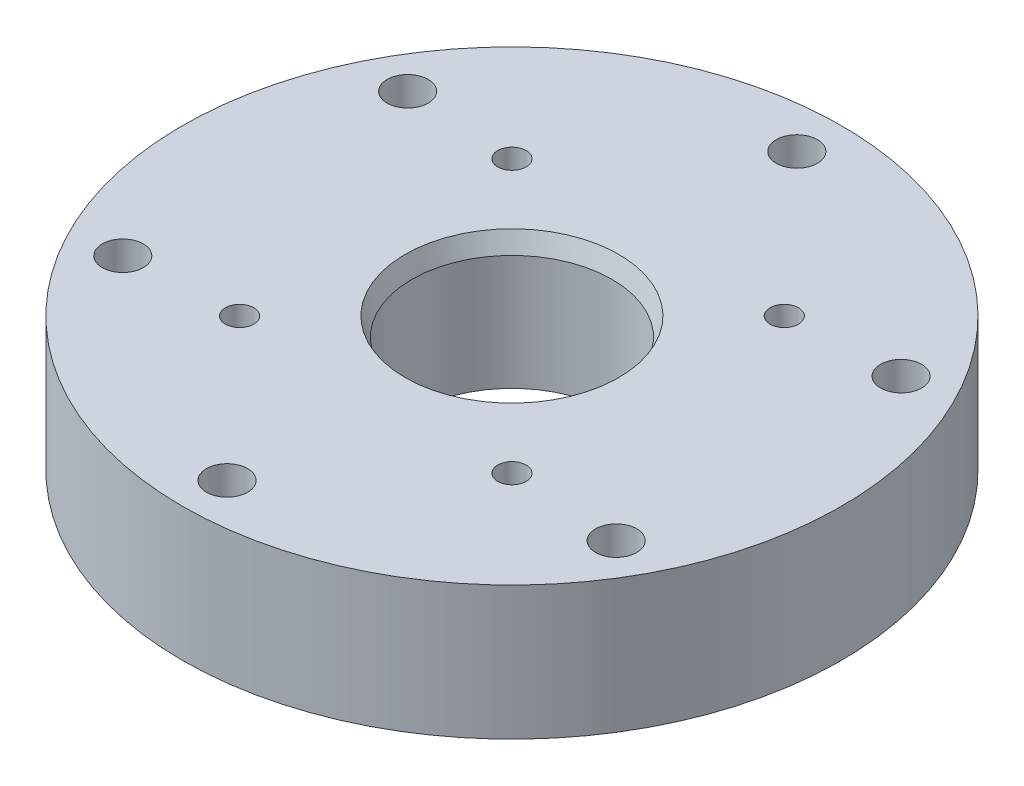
ISO-10303-21;
HEADER;
FILE_DESCRIPTION(('STEP AP214'),'2;1');
FILE_NAME('part.step','',(''),(''),'','','');
FILE_SCHEMA(('AUTOMOTIVE_DESIGN { 1 0 10303 214 1 1 1 1 }'));
ENDSEC;
DATA;
#1=APPLICATION_CONTEXT('core data for automotive mechanical design processes');
#2=APPLICATION_PROTOCOL_DEFINITION('international standard','automotive_design',2000,#1);
#3=PRODUCT_CONTEXT('',#1,'mechanical');
#4=PRODUCT('Part','Part','',(#3));
#5=PRODUCT_RELATED_PRODUCT_CATEGORY('part','',(#4));
#6=PRODUCT_DEFINITION_FORMATION('','',#4);
#7=PRODUCT_DEFINITION_CONTEXT('part definition',#1,'design');
#8=PRODUCT_DEFINITION('design','',#6,#7);
#9=PRODUCT_DEFINITION_SHAPE('','',#8);
#10=(LENGTH_UNIT() NAMED_UNIT(*) SI_UNIT(.MILLI.,.METRE.));
#11=(NAMED_UNIT(*) PLANE_ANGLE_UNIT() SI_UNIT($,.RADIAN.));
#12=(NAMED_UNIT(*) SI_UNIT($,.STERADIAN.) SOLID_ANGLE_UNIT());
#13=UNCERTAINTY_MEASURE_WITH_UNIT(LENGTH_MEASURE(1.E-05),#10,'distance_accuracy_value','');
#14=(GEOMETRIC_REPRESENTATION_CONTEXT(3) GLOBAL_UNCERTAINTY_ASSIGNED_CONTEXT((#13)) GLOBAL_UNIT_ASSIGNED_CONTEXT((#10,
#11,#12)) REPRESENTATION_CONTEXT('',''));
#15=CARTESIAN_POINT('',(0.,0.,0.));
#16=DIRECTION('',(0.,0.,1.));
#17=DIRECTION('',(1.,0.,0.));
#18=AXIS2_PLACEMENT_3D('',#15,#16,#17);
#19=CARTESIAN_POINT('',(31.353125,0.,0.));
#20=DIRECTION('',(0.,1.,0.));
#21=DIRECTION('',(0.,0.,1.));
#22=AXIS2_PLACEMENT_3D('',#19,#20,#21);
#23=PLANE('',#22);
#24=CARTESIAN_POINT('',(1.89084858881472E-13,0.,27.1017999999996));
#25=DIRECTION('',(0.,1.,0.));
#26=DIRECTION('',(0.866025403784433,0.,0.50000000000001));
#27=AXIS2_PLACEMENT_3D('',#24,#25,#26);
#28=CIRCLE('',#27,1.9558);
#29=CARTESIAN_POINT('',(1.69377248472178,0.,28.0796999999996));
#30=VERTEX_POINT('',#29);
#31=EDGE_CURVE('E85',#30,#30,#28,.T.);
#32=ORIENTED_EDGE('',*,*,#31,.T.);
#33=EDGE_LOOP('',(#32));
#34=FACE_BOUND('',#33,.T.);
#35=CARTESIAN_POINT('',(23.4708472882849,0.,13.5508999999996));
#36=DIRECTION('',(0.,1.,0.));
#37=DIRECTION('',(0.866025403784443,0.,-0.499999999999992));
#38=AXIS2_PLACEMENT_3D('',#35,#36,#37);
#39=CIRCLE('',#38,1.9558);
#40=CARTESIAN_POINT('',(25.1646197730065,0.,12.5729999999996));
#41=VERTEX_POINT('',#40);
#42=EDGE_CURVE('E91',#41,#41,#39,.T.);
#43=ORIENTED_EDGE('',*,*,#42,.T.);
#44=EDGE_LOOP('',(#43));
#45=FACE_BOUND('',#44,.T.);
#46=CARTESIAN_POINT('',(23.4708472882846,0.,-13.5509000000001));
#47=DIRECTION('',(0.,1.,0.));
#48=DIRECTION('',(0.,0.,-1.));
#49=AXIS2_PLACEMENT_3D('',#46,#47,#48);
#50=CIRCLE('',#49,1.9558);
#51=CARTESIAN_POINT('',(23.4708472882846,0.,-15.5067000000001));
#52=VERTEX_POINT('',#51);
#53=EDGE_CURVE('E97',#52,#52,#50,.T.);
#54=ORIENTED_EDGE('',*,*,#53,.T.);
#55=EDGE_LOOP('',(#54));
#56=FACE_BOUND('',#55,.T.);
#57=CARTESIAN_POINT('',(-3.79904441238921E-13,0.,-27.1017999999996));
#58=DIRECTION('',(0.,1.,0.));
#59=DIRECTION('',(-0.866025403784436,0.,-0.500000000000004));
#60=AXIS2_PLACEMENT_3D('',#57,#58,#59);
#61=CIRCLE('',#60,1.9558);
#62=CARTESIAN_POINT('',(-1.69377248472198,0.,-28.0796999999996));
#63=VERTEX_POINT('',#62);
#64=EDGE_CURVE('E103',#63,#63,#61,.T.);
#65=ORIENTED_EDGE('',*,*,#64,.T.);
#66=EDGE_LOOP('',(#65));
#67=FACE_BOUND('',#66,.T.);
#68=CARTESIAN_POINT('',(-23.470847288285,0.,-13.5508999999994));
#69=DIRECTION('',(0.,1.,0.));
#70=DIRECTION('',(-0.86602540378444,0.,0.499999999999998));
#71=AXIS2_PLACEMENT_3D('',#68,#69,#70);
#72=CIRCLE('',#71,1.9558);
#73=CARTESIAN_POINT('',(-25.1646197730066,0.,-12.5729999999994));
#74=VERTEX_POINT('',#73);
#75=EDGE_CURVE('E109',#74,#74,#72,.T.);
#76=ORIENTED_EDGE('',*,*,#75,.T.);
#77=EDGE_LOOP('',(#76));
#78=FACE_BOUND('',#77,.T.);
#79=CARTESIAN_POINT('',(-23.4708472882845,0.,13.5509000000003));
#80=DIRECTION('',(0.,1.,0.));
#81=DIRECTION('',(0.,0.,1.));
#82=AXIS2_PLACEMENT_3D('',#79,#80,#81);
#83=CIRCLE('',#82,1.9558);
#84=CARTESIAN_POINT('',(-23.4708472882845,0.,15.5067000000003));
#85=VERTEX_POINT('',#84);
#86=EDGE_CURVE('E115',#85,#85,#83,.T.);
#87=ORIENTED_EDGE('',*,*,#86,.T.);
#88=EDGE_LOOP('',(#87));
#89=FACE_BOUND('',#88,.T.);
#90=CARTESIAN_POINT('',(0.,0.,0.));
#91=DIRECTION('',(0.,1.,0.));
#92=DIRECTION('',(0.,0.,1.));
#93=AXIS2_PLACEMENT_3D('',#90,#91,#92);
#94=CIRCLE('',#93,31.353125);
#95=CARTESIAN_POINT('',(0.,0.,31.353125));
#96=VERTEX_POINT('',#95);
#97=EDGE_CURVE('E11',#96,#96,#94,.T.);
#98=ORIENTED_EDGE('',*,*,#97,.F.);
#99=EDGE_LOOP('',(#98));
#100=FACE_BOUND('',#99,.T.);
#101=CARTESIAN_POINT('',(0.,0.,0.));
#102=DIRECTION('',(0.,1.,0.));
#103=DIRECTION('',(0.,0.,1.));
#104=AXIS2_PLACEMENT_3D('',#101,#102,#103);
#105=CIRCLE('',#104,9.52500000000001);
#106=CARTESIAN_POINT('',(0.,0.,9.52500000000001));
#107=VERTEX_POINT('',#106);
#108=EDGE_CURVE('E118',#107,#107,#105,.T.);
#109=ORIENTED_EDGE('',*,*,#108,.T.);
#110=EDGE_LOOP('',(#109));
#111=FACE_BOUND('',#110,.T.);
#112=ADVANCED_FACE('F32',(#34,#45,#56,#67,#78,#89,#100,#111),#23,.F.);
#113=CARTESIAN_POINT('',(0.,61.0123711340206,0.));
#114=DIRECTION('',(0.,1.,0.));
#115=DIRECTION('',(0.,0.,1.));
#116=AXIS2_PLACEMENT_3D('',#113,#114,#115);
#117=CYLINDRICAL_SURFACE('',#116,31.353125);
#118=CARTESIAN_POINT('',(0.,12.7,0.));
#119=DIRECTION('',(0.,1.,0.));
#120=DIRECTION('',(0.,0.,1.));
#121=AXIS2_PLACEMENT_3D('',#118,#119,#120);
#122=CIRCLE('',#121,31.353125);
#123=CARTESIAN_POINT('',(0.,12.7,31.353125));
#124=VERTEX_POINT('',#123);
#125=EDGE_CURVE('E39',#124,#124,#122,.T.);
#126=ORIENTED_EDGE('',*,*,#125,.F.);
#127=EDGE_LOOP('',(#126));
#128=FACE_BOUND('',#127,.T.);
#129=ORIENTED_EDGE('',*,*,#97,.T.);
#130=EDGE_LOOP('',(#129));
#131=FACE_BOUND('',#130,.T.);
#132=ADVANCED_FACE('F133',(#128,#131),#117,.T.);
#133=CARTESIAN_POINT('',(10.16,12.7,0.));
#134=DIRECTION('',(0.,-1.,0.));
#135=DIRECTION('',(0.,0.,-1.));
#136=AXIS2_PLACEMENT_3D('',#133,#134,#135);
#137=PLANE('',#136);
#138=CARTESIAN_POINT('',(12.954,12.7,-12.954));
#139=DIRECTION('',(0.,1.,0.));
#140=DIRECTION('',(0.,0.,1.));
#141=AXIS2_PLACEMENT_3D('',#138,#139,#140);
#142=CIRCLE('',#141,1.3525488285);
#143=CARTESIAN_POINT('',(12.954,12.7,-11.6014511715));
#144=VERTEX_POINT('',#143);
#145=EDGE_CURVE('E61',#144,#144,#142,.T.);
#146=ORIENTED_EDGE('',*,*,#145,.F.);
#147=EDGE_LOOP('',(#146));
#148=FACE_BOUND('',#147,.T.);
#149=CARTESIAN_POINT('',(12.954,12.7,12.954));
#150=DIRECTION('',(0.,1.,0.));
#151=DIRECTION('',(0.,0.,1.));
#152=AXIS2_PLACEMENT_3D('',#149,#150,#151);
#153=CIRCLE('',#152,1.3525488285);
#154=CARTESIAN_POINT('',(12.954,12.7,14.3065488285));
#155=VERTEX_POINT('',#154);
#156=EDGE_CURVE('E69',#155,#155,#153,.T.);
#157=ORIENTED_EDGE('',*,*,#156,.F.);
#158=EDGE_LOOP('',(#157));
#159=FACE_BOUND('',#158,.T.);
#160=CARTESIAN_POINT('',(-12.954,12.7,-12.954));
#161=DIRECTION('',(0.,1.,0.));
#162=DIRECTION('',(0.,0.,1.));
#163=AXIS2_PLACEMENT_3D('',#160,#161,#162);
#164=CIRCLE('',#163,1.3525488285);
#165=CARTESIAN_POINT('',(-12.954,12.7,-11.6014511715));
#166=VERTEX_POINT('',#165);
#167=EDGE_CURVE('E75',#166,#166,#164,.T.);
#168=ORIENTED_EDGE('',*,*,#167,.F.);
#169=EDGE_LOOP('',(#168));
#170=FACE_BOUND('',#169,.T.);
#171=CARTESIAN_POINT('',(-12.954,12.7,12.954));
#172=DIRECTION('',(0.,1.,0.));
#173=DIRECTION('',(0.,0.,1.));
#174=AXIS2_PLACEMENT_3D('',#171,#172,#173);
#175=CIRCLE('',#174,1.3525488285);
#176=CARTESIAN_POINT('',(-12.954,12.7,14.3065488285));
#177=VERTEX_POINT('',#176);
#178=EDGE_CURVE('E81',#177,#177,#175,.T.);
#179=ORIENTED_EDGE('',*,*,#178,.F.);
#180=EDGE_LOOP('',(#179));
#181=FACE_BOUND('',#180,.T.);
#182=CARTESIAN_POINT('',(1.89084858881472E-13,12.7,27.1017999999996));
#183=DIRECTION('',(0.,1.,0.));
#184=DIRECTION('',(0.866025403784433,0.,0.50000000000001));
#185=AXIS2_PLACEMENT_3D('',#182,#183,#184);
#186=CIRCLE('',#185,1.9558);
#187=CARTESIAN_POINT('',(1.69377248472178,12.7,28.0796999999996));
#188=VERTEX_POINT('',#187);
#189=EDGE_CURVE('E84',#188,#188,#186,.T.);
#190=ORIENTED_EDGE('',*,*,#189,.F.);
#191=EDGE_LOOP('',(#190));
#192=FACE_BOUND('',#191,.T.);
#193=CARTESIAN_POINT('',(23.4708472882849,12.7,13.5508999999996));
#194=DIRECTION('',(0.,1.,0.));
#195=DIRECTION('',(0.866025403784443,0.,-0.499999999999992));
#196=AXIS2_PLACEMENT_3D('',#193,#194,#195);
#197=CIRCLE('',#196,1.9558);
#198=CARTESIAN_POINT('',(25.1646197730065,12.7,12.5729999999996));
#199=VERTEX_POINT('',#198);
#200=EDGE_CURVE('E88',#199,#199,#197,.T.);
#201=ORIENTED_EDGE('',*,*,#200,.F.);
#202=EDGE_LOOP('',(#201));
#203=FACE_BOUND('',#202,.T.);
#204=CARTESIAN_POINT('',(23.4708472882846,12.7,-13.5509000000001));
#205=DIRECTION('',(0.,1.,0.));
#206=DIRECTION('',(0.,0.,-1.));
#207=AXIS2_PLACEMENT_3D('',#204,#205,#206);
#208=CIRCLE('',#207,1.9558);
#209=CARTESIAN_POINT('',(23.4708472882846,12.7,-15.5067000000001));
#210=VERTEX_POINT('',#209);
#211=EDGE_CURVE('E94',#210,#210,#208,.T.);
#212=ORIENTED_EDGE('',*,*,#211,.F.);
#213=EDGE_LOOP('',(#212));
#214=FACE_BOUND('',#213,.T.);
#215=CARTESIAN_POINT('',(-3.79904441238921E-13,12.7,-27.1017999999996));
#216=DIRECTION('',(0.,1.,0.));
#217=DIRECTION('',(-0.866025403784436,0.,-0.500000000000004));
#218=AXIS2_PLACEMENT_3D('',#215,#216,#217);
#219=CIRCLE('',#218,1.9558);
#220=CARTESIAN_POINT('',(-1.69377248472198,12.7,-28.0796999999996));
#221=VERTEX_POINT('',#220);
#222=EDGE_CURVE('E100',#221,#221,#219,.T.);
#223=ORIENTED_EDGE('',*,*,#222,.F.);
#224=EDGE_LOOP('',(#223));
#225=FACE_BOUND('',#224,.T.);
#226=CARTESIAN_POINT('',(-23.470847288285,12.7,-13.5508999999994));
#227=DIRECTION('',(0.,1.,0.));
#228=DIRECTION('',(-0.86602540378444,0.,0.499999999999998));
#229=AXIS2_PLACEMENT_3D('',#226,#227,#228);
#230=CIRCLE('',#229,1.9558);
#231=CARTESIAN_POINT('',(-25.1646197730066,12.7,-12.5729999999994));
#232=VERTEX_POINT('',#231);
#233=EDGE_CURVE('E106',#232,#232,#230,.T.);
#234=ORIENTED_EDGE('',*,*,#233,.F.);
#235=EDGE_LOOP('',(#234));
#236=FACE_BOUND('',#235,.T.);
#237=CARTESIAN_POINT('',(-23.4708472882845,12.7,13.5509000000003));
#238=DIRECTION('',(0.,1.,0.));
#239=DIRECTION('',(0.,0.,1.));
#240=AXIS2_PLACEMENT_3D('',#237,#238,#239);
#241=CIRCLE('',#240,1.9558);
#242=CARTESIAN_POINT('',(-23.4708472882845,12.7,15.5067000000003));
#243=VERTEX_POINT('',#242);
#244=EDGE_CURVE('E112',#243,#243,#241,.T.);
#245=ORIENTED_EDGE('',*,*,#244,.F.);
#246=EDGE_LOOP('',(#245));
#247=FACE_BOUND('',#246,.T.);
#248=CARTESIAN_POINT('',(0.,12.7,0.));
#249=DIRECTION('',(0.,1.,0.));
#250=DIRECTION('',(0.,0.,1.));
#251=AXIS2_PLACEMENT_3D('',#248,#249,#250);
#252=CIRCLE('',#251,10.16);
#253=CARTESIAN_POINT('',(0.,12.7,10.16));
#254=VERTEX_POINT('',#253);
#255=EDGE_CURVE('E126',#254,#254,#252,.T.);
#256=ORIENTED_EDGE('',*,*,#255,.F.);
#257=EDGE_LOOP('',(#256));
#258=FACE_BOUND('',#257,.T.);
#259=ORIENTED_EDGE('',*,*,#125,.T.);
#260=EDGE_LOOP('',(#259));
#261=FACE_BOUND('',#260,.T.);
#262=ADVANCED_FACE('F131',(#148,#159,#170,#181,#192,#203,#214,#225,#236,#247,#258,#261),#137,.F.);
#263=CARTESIAN_POINT('',(0.,12.7,0.));
#264=DIRECTION('',(0.,1.,0.));
#265=DIRECTION('',(0.,0.,1.));
#266=AXIS2_PLACEMENT_3D('',#263,#264,#265);
#267=CONICAL_SURFACE('',#266,10.16,0.349065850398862);
#268=CARTESIAN_POINT('',(0.,10.9553518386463,0.));
#269=DIRECTION('',(0.,1.,0.));
#270=DIRECTION('',(0.,0.,1.));
#271=AXIS2_PLACEMENT_3D('',#268,#269,#270);
#272=CIRCLE('',#271,9.525);
#273=CARTESIAN_POINT('',(0.,10.9553518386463,9.525));
#274=VERTEX_POINT('',#273);
#275=EDGE_CURVE('E123',#274,#274,#272,.T.);
#276=ORIENTED_EDGE('',*,*,#275,.F.);
#277=EDGE_LOOP('',(#276));
#278=FACE_BOUND('',#277,.T.);
#279=ORIENTED_EDGE('',*,*,#255,.T.);
#280=EDGE_LOOP('',(#279));
#281=FACE_BOUND('',#280,.T.);
#282=ADVANCED_FACE('F147',(#278,#281),#267,.F.);
#283=CARTESIAN_POINT('',(0.,61.0123711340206,0.));
#284=DIRECTION('',(0.,1.,0.));
#285=DIRECTION('',(0.,0.,1.));
#286=AXIS2_PLACEMENT_3D('',#283,#284,#285);
#287=CYLINDRICAL_SURFACE('',#286,9.525);
#288=ORIENTED_EDGE('',*,*,#108,.F.);
#289=EDGE_LOOP('',(#288));
#290=FACE_BOUND('',#289,.T.);
#291=ORIENTED_EDGE('',*,*,#275,.T.);
#292=EDGE_LOOP('',(#291));
#293=FACE_BOUND('',#292,.T.);
#294=ADVANCED_FACE('F143',(#290,#293),#287,.F.);
#295=CARTESIAN_POINT('',(-23.4708472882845,0.,13.5509000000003));
#296=DIRECTION('',(0.,1.,0.));
#297=DIRECTION('',(0.,0.,1.));
#298=AXIS2_PLACEMENT_3D('',#295,#296,#297);
#299=CYLINDRICAL_SURFACE('',#298,1.9558);
#300=ORIENTED_EDGE('',*,*,#86,.F.);
#301=EDGE_LOOP('',(#300));
#302=FACE_BOUND('',#301,.T.);
#303=ORIENTED_EDGE('',*,*,#244,.T.);
#304=EDGE_LOOP('',(#303));
#305=FACE_BOUND('',#304,.T.);
#306=ADVANCED_FACE('F146',(#302,#305),#299,.F.);
#307=CARTESIAN_POINT('',(-23.470847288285,0.,-13.5508999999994));
#308=DIRECTION('',(0.,1.,0.));
#309=DIRECTION('',(0.,0.,1.));
#310=AXIS2_PLACEMENT_3D('',#307,#308,#309);
#311=CYLINDRICAL_SURFACE('',#310,1.9558);
#312=ORIENTED_EDGE('',*,*,#75,.F.);
#313=EDGE_LOOP('',(#312));
#314=FACE_BOUND('',#313,.T.);
#315=ORIENTED_EDGE('',*,*,#233,.T.);
#316=EDGE_LOOP('',(#315));
#317=FACE_BOUND('',#316,.T.);
#318=ADVANCED_FACE('F166',(#314,#317),#311,.F.);
#319=CARTESIAN_POINT('',(-3.79904441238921E-13,0.,-27.1017999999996));
#320=DIRECTION('',(0.,1.,0.));
#321=DIRECTION('',(0.,0.,1.));
#322=AXIS2_PLACEMENT_3D('',#319,#320,#321);
#323=CYLINDRICAL_SURFACE('',#322,1.9558);
#324=ORIENTED_EDGE('',*,*,#64,.F.);
#325=EDGE_LOOP('',(#324));
#326=FACE_BOUND('',#325,.T.);
#327=ORIENTED_EDGE('',*,*,#222,.T.);
#328=EDGE_LOOP('',(#327));
#329=FACE_BOUND('',#328,.T.);
#330=ADVANCED_FACE('F170',(#326,#329),#323,.F.);
#331=CARTESIAN_POINT('',(23.4708472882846,0.,-13.5509000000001));
#332=DIRECTION('',(0.,1.,0.));
#333=DIRECTION('',(0.,0.,1.));
#334=AXIS2_PLACEMENT_3D('',#331,#332,#333);
#335=CYLINDRICAL_SURFACE('',#334,1.9558);
#336=ORIENTED_EDGE('',*,*,#53,.F.);
#337=EDGE_LOOP('',(#336));
#338=FACE_BOUND('',#337,.T.);
#339=ORIENTED_EDGE('',*,*,#211,.T.);
#340=EDGE_LOOP('',(#339));
#341=FACE_BOUND('',#340,.T.);
#342=ADVANCED_FACE('F174',(#338,#341),#335,.F.);
#343=CARTESIAN_POINT('',(23.4708472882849,0.,13.5508999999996));
#344=DIRECTION('',(0.,1.,0.));
#345=DIRECTION('',(0.,0.,1.));
#346=AXIS2_PLACEMENT_3D('',#343,#344,#345);
#347=CYLINDRICAL_SURFACE('',#346,1.9558);
#348=ORIENTED_EDGE('',*,*,#42,.F.);
#349=EDGE_LOOP('',(#348));
#350=FACE_BOUND('',#349,.T.);
#351=ORIENTED_EDGE('',*,*,#200,.T.);
#352=EDGE_LOOP('',(#351));
#353=FACE_BOUND('',#352,.T.);
#354=ADVANCED_FACE('F178',(#350,#353),#347,.F.);
#355=CARTESIAN_POINT('',(1.89084858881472E-13,0.,27.1017999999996));
#356=DIRECTION('',(0.,1.,0.));
#357=DIRECTION('',(0.,0.,1.));
#358=AXIS2_PLACEMENT_3D('',#355,#356,#357);
#359=CYLINDRICAL_SURFACE('',#358,1.9558);
#360=ORIENTED_EDGE('',*,*,#31,.F.);
#361=EDGE_LOOP('',(#360));
#362=FACE_BOUND('',#361,.T.);
#363=ORIENTED_EDGE('',*,*,#189,.T.);
#364=EDGE_LOOP('',(#363));
#365=FACE_BOUND('',#364,.T.);
#366=ADVANCED_FACE('F182',(#362,#365),#359,.F.);
#367=CARTESIAN_POINT('',(-12.954,12.7,12.954));
#368=DIRECTION('',(0.,1.,0.));
#369=DIRECTION('',(0.,0.,1.));
#370=AXIS2_PLACEMENT_3D('',#367,#368,#369);
#371=CYLINDRICAL_SURFACE('',#370,1.35254882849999);
#372=CARTESIAN_POINT('',(-12.954,3.17499999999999,12.954));
#373=DIRECTION('',(0.,1.,0.));
#374=DIRECTION('',(0.,0.,1.));
#375=AXIS2_PLACEMENT_3D('',#372,#373,#374);
#376=CIRCLE('',#375,1.3525488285);
#377=CARTESIAN_POINT('',(-12.954,3.17499999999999,14.3065488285));
#378=VERTEX_POINT('',#377);
#379=EDGE_CURVE('E78',#378,#378,#376,.T.);
#380=ORIENTED_EDGE('',*,*,#379,.F.);
#381=EDGE_LOOP('',(#380));
#382=FACE_BOUND('',#381,.T.);
#383=ORIENTED_EDGE('',*,*,#178,.T.);
#384=EDGE_LOOP('',(#383));
#385=FACE_BOUND('',#384,.T.);
#386=ADVANCED_FACE('F186',(#382,#385),#371,.F.);
#387=CARTESIAN_POINT('',(-12.954,3.17499999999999,12.954));
#388=DIRECTION('',(0.,1.,0.));
#389=DIRECTION('',(0.,0.,1.));
#390=AXIS2_PLACEMENT_3D('',#387,#388,#389);
#391=CONICAL_SURFACE('',#390,1.3525488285,1.02974425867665);
#392=CARTESIAN_POINT('',(-12.954,2.36230667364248,12.954));
#393=VERTEX_POINT('',#392);
#394=VERTEX_LOOP('',#393);
#395=FACE_BOUND('',#394,.T.);
#396=ORIENTED_EDGE('',*,*,#379,.T.);
#397=EDGE_LOOP('',(#396));
#398=FACE_BOUND('',#397,.T.);
#399=ADVANCED_FACE('F190',(#395,#398),#391,.F.);
#400=CARTESIAN_POINT('',(-12.954,12.7,-12.954));
#401=DIRECTION('',(0.,1.,0.));
#402=DIRECTION('',(0.,0.,1.));
#403=AXIS2_PLACEMENT_3D('',#400,#401,#402);
#404=CYLINDRICAL_SURFACE('',#403,1.35254882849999);
#405=CARTESIAN_POINT('',(-12.954,3.17499999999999,-12.954));
#406=DIRECTION('',(0.,1.,0.));
#407=DIRECTION('',(0.,0.,1.));
#408=AXIS2_PLACEMENT_3D('',#405,#406,#407);
#409=CIRCLE('',#408,1.3525488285);
#410=CARTESIAN_POINT('',(-12.954,3.17499999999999,-11.6014511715));
#411=VERTEX_POINT('',#410);
#412=EDGE_CURVE('E72',#411,#411,#409,.T.);
#413=ORIENTED_EDGE('',*,*,#412,.F.);
#414=EDGE_LOOP('',(#413));
#415=FACE_BOUND('',#414,.T.);
#416=ORIENTED_EDGE('',*,*,#167,.T.);
#417=EDGE_LOOP('',(#416));
#418=FACE_BOUND('',#417,.T.);
#419=ADVANCED_FACE('F194',(#415,#418),#404,.F.);
#420=CARTESIAN_POINT('',(-12.954,3.17499999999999,-12.954));
#421=DIRECTION('',(0.,1.,0.));
#422=DIRECTION('',(0.,0.,1.));
#423=AXIS2_PLACEMENT_3D('',#420,#421,#422);
#424=CONICAL_SURFACE('',#423,1.3525488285,1.02974425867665);
#425=CARTESIAN_POINT('',(-12.954,2.36230667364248,-12.954));
#426=VERTEX_POINT('',#425);
#427=VERTEX_LOOP('',#426);
#428=FACE_BOUND('',#427,.T.);
#429=ORIENTED_EDGE('',*,*,#412,.T.);
#430=EDGE_LOOP('',(#429));
#431=FACE_BOUND('',#430,.T.);
#432=ADVANCED_FACE('F197',(#428,#431),#424,.F.);
#433=CARTESIAN_POINT('',(12.954,12.7,12.954));
#434=DIRECTION('',(0.,1.,0.));
#435=DIRECTION('',(0.,0.,1.));
#436=AXIS2_PLACEMENT_3D('',#433,#434,#435);
#437=CYLINDRICAL_SURFACE('',#436,1.35254882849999);
#438=CARTESIAN_POINT('',(12.954,3.17499999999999,12.954));
#439=DIRECTION('',(0.,1.,0.));
#440=DIRECTION('',(0.,0.,1.));
#441=AXIS2_PLACEMENT_3D('',#438,#439,#440);
#442=CIRCLE('',#441,1.3525488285);
#443=CARTESIAN_POINT('',(12.954,3.17499999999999,14.3065488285));
#444=VERTEX_POINT('',#443);
#445=EDGE_CURVE('E64',#444,#444,#442,.T.);
#446=ORIENTED_EDGE('',*,*,#445,.F.);
#447=EDGE_LOOP('',(#446));
#448=FACE_BOUND('',#447,.T.);
#449=ORIENTED_EDGE('',*,*,#156,.T.);
#450=EDGE_LOOP('',(#449));
#451=FACE_BOUND('',#450,.T.);
#452=ADVANCED_FACE('F201',(#448,#451),#437,.F.);
#453=CARTESIAN_POINT('',(12.954,3.17499999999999,12.954));
#454=DIRECTION('',(0.,1.,0.));
#455=DIRECTION('',(0.,0.,1.));
#456=AXIS2_PLACEMENT_3D('',#453,#454,#455);
#457=CONICAL_SURFACE('',#456,1.3525488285,1.02974425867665);
#458=CARTESIAN_POINT('',(12.954,2.36230667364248,12.954));
#459=VERTEX_POINT('',#458);
#460=VERTEX_LOOP('',#459);
#461=FACE_BOUND('',#460,.T.);
#462=ORIENTED_EDGE('',*,*,#445,.T.);
#463=EDGE_LOOP('',(#462));
#464=FACE_BOUND('',#463,.T.);
#465=ADVANCED_FACE('F204',(#461,#464),#457,.F.);
#466=CARTESIAN_POINT('',(12.954,12.7,-12.954));
#467=DIRECTION('',(0.,1.,0.));
#468=DIRECTION('',(0.,0.,1.));
#469=AXIS2_PLACEMENT_3D('',#466,#467,#468);
#470=CYLINDRICAL_SURFACE('',#469,1.35254882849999);
#471=CARTESIAN_POINT('',(12.954,3.17499999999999,-12.954));
#472=DIRECTION('',(0.,1.,0.));
#473=DIRECTION('',(0.,0.,1.));
#474=AXIS2_PLACEMENT_3D('',#471,#472,#473);
#475=CIRCLE('',#474,1.3525488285);
#476=CARTESIAN_POINT('',(12.954,3.17499999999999,-11.6014511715));
#477=VERTEX_POINT('',#476);
#478=EDGE_CURVE('E59',#477,#477,#475,.T.);
#479=ORIENTED_EDGE('',*,*,#478,.F.);
#480=EDGE_LOOP('',(#479));
#481=FACE_BOUND('',#480,.T.);
#482=ORIENTED_EDGE('',*,*,#145,.T.);
#483=EDGE_LOOP('',(#482));
#484=FACE_BOUND('',#483,.T.);
#485=ADVANCED_FACE('F55',(#481,#484),#470,.F.);
#486=CARTESIAN_POINT('',(12.954,3.17499999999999,-12.954));
#487=DIRECTION('',(0.,1.,0.));
#488=DIRECTION('',(0.,0.,1.));
#489=AXIS2_PLACEMENT_3D('',#486,#487,#488);
#490=CONICAL_SURFACE('',#489,1.3525488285,1.02974425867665);
#491=CARTESIAN_POINT('',(12.954,2.36230667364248,-12.954));
#492=VERTEX_POINT('',#491);
#493=VERTEX_LOOP('',#492);
#494=FACE_BOUND('',#493,.T.);
#495=ORIENTED_EDGE('',*,*,#478,.T.);
#496=EDGE_LOOP('',(#495));
#497=FACE_BOUND('',#496,.T.);
#498=ADVANCED_FACE('F52',(#494,#497),#490,.F.);
#499=CLOSED_SHELL('',(#112,#132,#262,#282,#294,#306,#318,#330,#342,#354,#366,#386,#399,#419,
#432,#452,#465,#485,#498));
#500=MANIFOLD_SOLID_BREP('B2',#499);
#501=ADVANCED_BREP_SHAPE_REPRESENTATION('',(#18,#500),#14);
#502=SHAPE_DEFINITION_REPRESENTATION(#9,#501);
ENDSEC;
END-ISO-10303-21;
